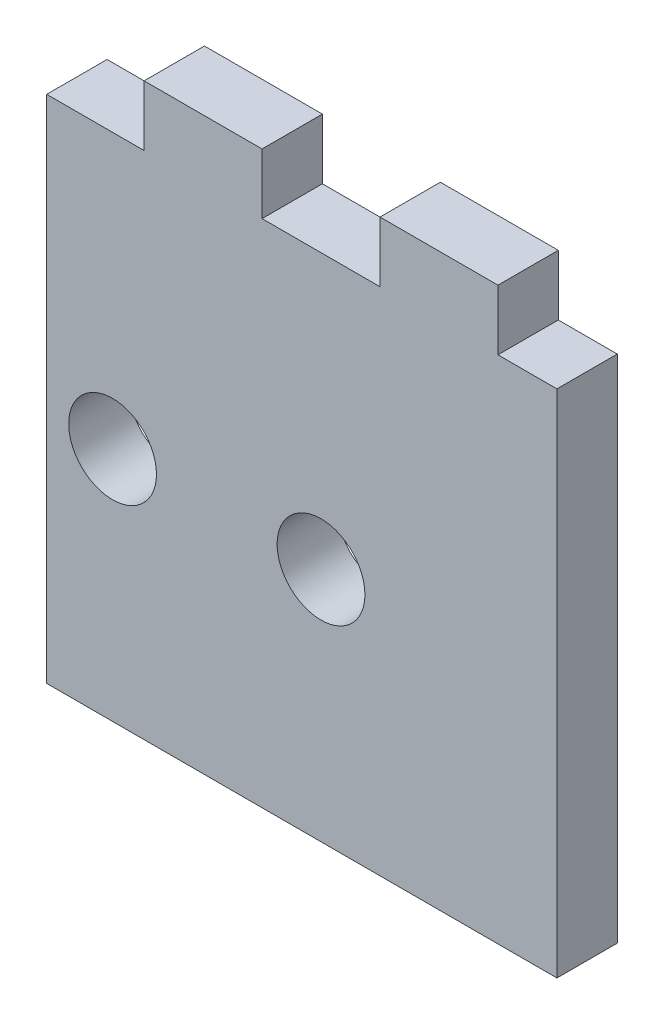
from build123d import *

# Parameters (mm, degrees)
SKETCH2_R           = 4
BOSS_EXTRUDE1_DEPTH = 5.5


with BuildPart() as part:
    # Sketch2 → Boss-Extrude1 (new body)
    with BuildSketch(Plane.XY):
        Polygon((-43, 0), (0, 0), (0, 46.5), (-5.375, 46.5), (-5.375, 52), (-16.125, 52), (-16.125, 46.5), (-26.875, 46.5), (-26.875, 52), (-37.625, 52), (-37.625, 46.5), (-46.5, 46.5), (-46.5, 0), align=None)
        with Locations((-21.5, 21.5)):
            Circle(SKETCH2_R, mode=Mode.SUBTRACT)
        with Locations((-40.5, 21.5)):
            Circle(SKETCH2_R, mode=Mode.SUBTRACT)
    extrude(amount=BOSS_EXTRUDE1_DEPTH)


solid = part.part
